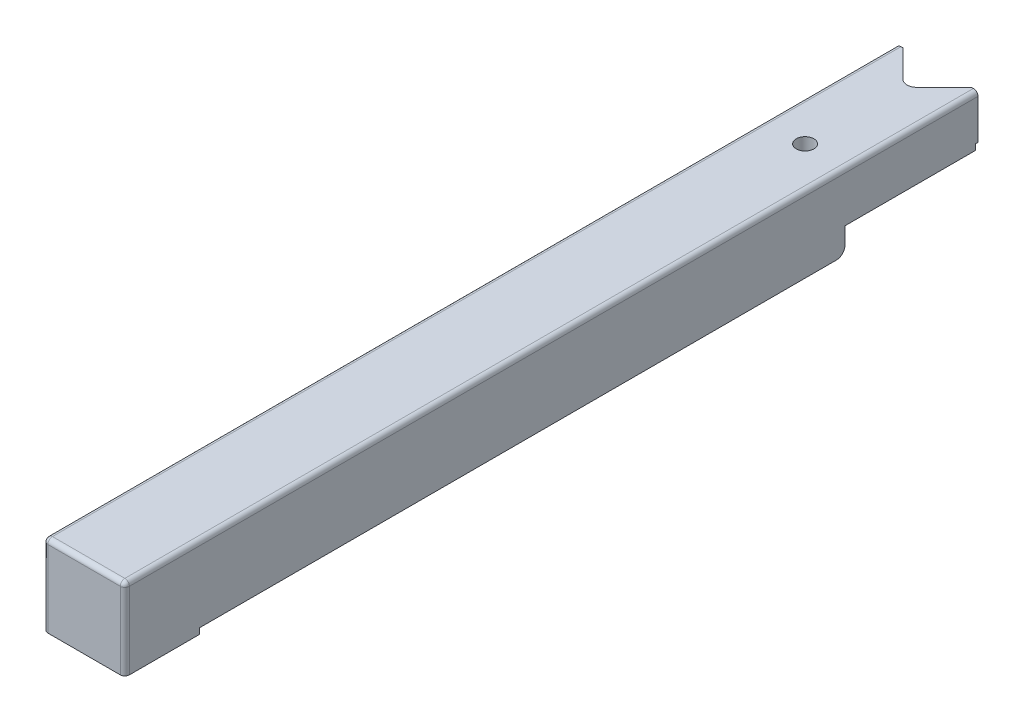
from build123d import *

# Parameters (mm, degrees)
BOSS_EXTRUDE1_DEPTH             = 22.606
SHELL3_T                        = -4.7752
SKETCH3_W                       = 45.212
SKETCH3_H                       = 3.302
BOSS_EXTRUDE2_DEPTH             = 41.275
FILLET1_R                       = 2.54
SKETCH4_W                       = 72.364618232
SKETCH4_H                       = 3.175
BOSS_EXTRUDE3_DEPTH             = 45.212
BOSS_EXTRUDE4_REACH             = 477.756
SKETCH5_R                       = 8.0645
SKETCH6_R                       = 4.8895
CUT_EXTRUDE1_DEPTH              = 475.430764
SKETCH7_R                       = 17.526
BOSS_EXTRUDE5_DEPTH             = 3.175
TAP_DRILL_FOR_1_2_13_TAP1_D     = 10.71626
TAP_DRILL_FOR_1_2_13_TAP1_DEPTH = 6.477
CUT_EXTRUDE2_DEPTH              = 477.067237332
CUT_EXTRUDE2_DEPTH_BACK         = 477.067237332
CUT_EXTRUDE3_DEPTH              = 475.430764
CUT_EXTRUDE3_DEPTH_BACK         = 3.175


with BuildPart() as part:
    # Sketch1 → Boss-Extrude1 (new, symmetric)
    with BuildSketch(Plane(origin=(0, 0, 0), x_dir=(0, 0, -1), z_dir=(1, 0, 0))):
        with BuildLine():
            Line((394.538181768, -41.91), (41.275, -41.91))
            Line((41.275, -41.91), (41.275, -45.085))
            Line((41.275, -45.085), (0, -45.085))
            Line((0, -45.085), (0, 0))
            Line((0, 0), (473.075, 0))
            Line((473.075, 0), (473.075, -24.638))
            Line((473.075, -24.638), (471.678, -24.638))
            Line((471.678, -24.638), (471.678, -27.813))
            Line((471.678, -27.813), (399.313381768, -27.813))
            Line((399.313381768, -27.813), (399.313381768, -37.1348))
            ThreePointArc((399.313381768, -37.1348), (397.914758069, -40.511376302), (394.538181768, -41.91))
        make_face()
    extrude(amount=BOSS_EXTRUDE1_DEPTH, both=True)

    # Shell3
    shell3_openings = [part.faces().sort_by_distance(p)[0] for p in [
        (0, -41.91, -217.906590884),
        (0, -43.4975, -41.275),
        (0, -45.085, -20.6375),
        (0, -12.319, -473.075),
        (0, -24.638, -472.3765),
        (0, -26.2255, -471.678),
        (0, -27.813, -435.495690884),
        (0, -32.4739, -399.313381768),
        (0, -40.511376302, -397.914758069),
    ]]
    offset(amount=SHELL3_T, openings=shell3_openings, kind=Kind.INTERSECTION)

    # Sketch3 → Boss-Extrude2 (add)
    with BuildSketch(Plane.XY):
        with Locations((0, -43.434)):
            Rectangle(SKETCH3_W, SKETCH3_H)
    extrude(amount=-BOSS_EXTRUDE2_DEPTH)

    # Fillet1
    fillet1_edges = [part.edges().sort_by_distance(p)[0] for p in [
        (-22.606, -22.5425, 0),
        (-22.606, 0, -236.5375),
        (0, 0, 0),
        (22.606, 0, -236.5375),
        (22.606, -22.5425, 0),
    ]]
    fillet(fillet1_edges, radius=FILLET1_R)

    # Sketch4 → Boss-Extrude3 (add)
    with BuildSketch(Plane(origin=(22.606, 0, 0), x_dir=(0, 0, -1), z_dir=(1, 0, 0))):
        with Locations((435.495690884, -26.2255)):
            Rectangle(SKETCH4_W, SKETCH4_H)
    extrude(amount=-BOSS_EXTRUDE3_DEPTH)

    # Boss-Extrude4: up to this face of the body (flat: up to its plane)
    boss_extrude4_end = Plane(part.part.faces().sort_by_distance((0, -27.813, -435.495690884))[0])
    # Sketch5 → Boss-Extrude4 (add, up to the picked face)
    with BuildSketch(Plane(origin=(0, 0, 0), x_dir=(1, 0, 0), z_dir=(0, 1, 0)), mode=Mode.PRIVATE) as boss_extrude4_sk1:
        with Locations(Location((0, 399.796, 0), (0, 0, 183.430903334))):
            Circle(SKETCH5_R)
    boss_extrude4_tool1 = split(extrude(boss_extrude4_sk1.sketch, amount=-BOSS_EXTRUDE4_REACH, mode=Mode.PRIVATE), bisect_by=boss_extrude4_end, keep=Keep.BOTH, mode=Mode.PRIVATE)
    add(boss_extrude4_tool1.solids().sort_by(Axis((0, 0, -399.796), (0, -1, 0)))[0])

    # Sketch6 → Cut-Extrude1 (cut, through all)
    with BuildSketch(Plane.XZ.offset(27.813)):
        with Locations(Location((0, -399.796, 0), (0, 0, 270))):
            Circle(SKETCH6_R)
    extrude(amount=-CUT_EXTRUDE1_DEPTH, mode=Mode.SUBTRACT)

    # Sketch7 → Boss-Extrude5 (add)
    with BuildSketch(Plane.XZ.offset(45.085)):
        with Locations(Location((0, -22.352, 0), (0, 0, 270))):
            Circle(SKETCH7_R)
    extrude(amount=BOSS_EXTRUDE5_DEPTH)

    # Tap Drill for 1_2-13 Tap1
    with Locations(Plane(origin=(0, -48.26, 0), x_dir=(-1, 0, 0), z_dir=(0, -1, 0))):
        with Locations((0, 22.352)):
            Hole(TAP_DRILL_FOR_1_2_13_TAP1_D / 2, depth=TAP_DRILL_FOR_1_2_13_TAP1_DEPTH)

    # Sketch10 → Cut-Extrude2 (cut, two sides: drawn at the far end of the back side and taken through both)
    with BuildSketch(Plane(origin=(0, 0, 0), x_dir=(1, 0, 0), z_dir=(0, 1, 0)).offset(-CUT_EXTRUDE2_DEPTH_BACK)):
        with BuildLine():
            Line((-697.738783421, 1151.763783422), (-19.049999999, 473.075))
            Line((-19.049999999, 473.075), (-3.951312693, 457.976312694))
            ThreePointArc((-3.951312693, 457.976312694), (1e-09, 456.339625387), (3.951312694, 457.976312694))
            Line((3.951312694, 457.976312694), (19.05, 473.075))
            Line((19.05, 473.075), (697.738783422, 1151.763783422))
            Line((697.738783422, 1151.763783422), (697.738783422, 3071.385547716))
            Line((697.738783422, 3071.385547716), (-697.738783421, 3071.385547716))
            Line((-697.738783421, 3071.385547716), (-697.738783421, 1151.763783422))
        make_face()
    extrude(amount=CUT_EXTRUDE2_DEPTH + CUT_EXTRUDE2_DEPTH_BACK, mode=Mode.SUBTRACT)

    # Sketch11 → Cut-Extrude3 (cut, two sides: drawn at the far end of the back side and taken through both)
    with BuildSketch(Plane.XZ.offset(27.813).offset(-CUT_EXTRUDE3_DEPTH_BACK)):
        with BuildLine():
            Line((697.48780769, -1148.59180769), (20.574, -471.678))
            Line((20.574, -471.678), (3.951312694, -455.055312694))
            ThreePointArc((3.951312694, -455.055312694), (1e-09, -453.418625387), (-3.951312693, -455.055312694))
            Line((-3.951312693, -455.055312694), (-20.573999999, -471.678))
            Line((-20.573999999, -471.678), (-697.487807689, -1148.59180769))
            Line((-697.487807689, -1148.59180769), (-697.487807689, -3063.193182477))
            Line((-697.487807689, -3063.193182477), (697.48780769, -3063.193182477))
            Line((697.48780769, -3063.193182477), (697.48780769, -1148.59180769))
        make_face()
    extrude(amount=CUT_EXTRUDE3_DEPTH + CUT_EXTRUDE3_DEPTH_BACK, mode=Mode.SUBTRACT)


solid = part.part
